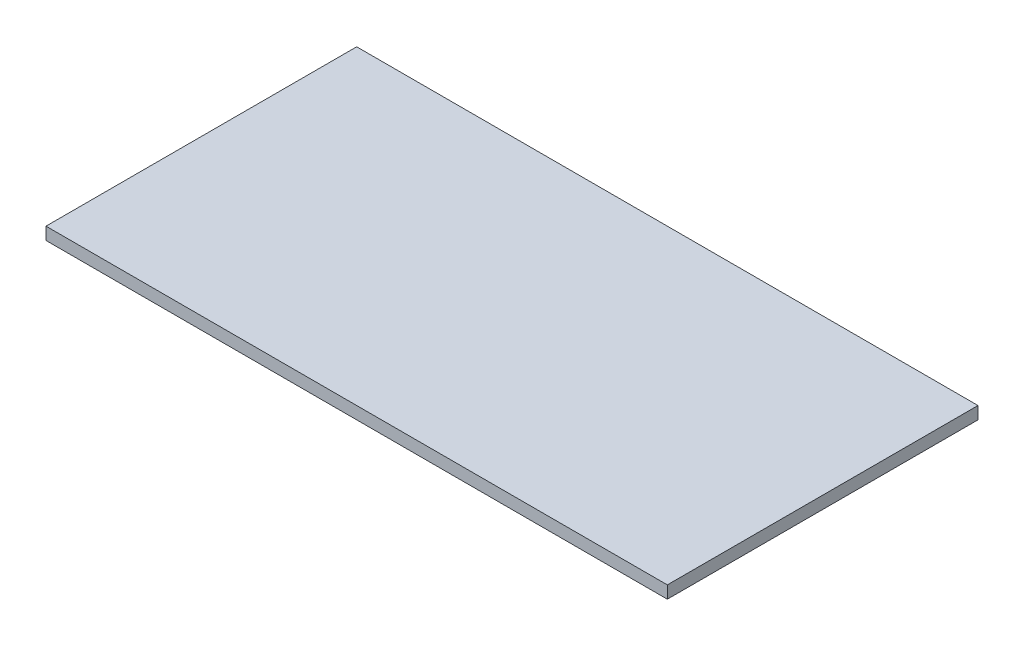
ISO-10303-21;
HEADER;
FILE_DESCRIPTION(('STEP AP214'),'2;1');
FILE_NAME('part.step','',(''),(''),'','','');
FILE_SCHEMA(('AUTOMOTIVE_DESIGN { 1 0 10303 214 1 1 1 1 }'));
ENDSEC;
DATA;
#1=APPLICATION_CONTEXT('core data for automotive mechanical design processes');
#2=APPLICATION_PROTOCOL_DEFINITION('international standard','automotive_design',2000,#1);
#3=PRODUCT_CONTEXT('',#1,'mechanical');
#4=PRODUCT('Part','Part','',(#3));
#5=PRODUCT_RELATED_PRODUCT_CATEGORY('part','',(#4));
#6=PRODUCT_DEFINITION_FORMATION('','',#4);
#7=PRODUCT_DEFINITION_CONTEXT('part definition',#1,'design');
#8=PRODUCT_DEFINITION('design','',#6,#7);
#9=PRODUCT_DEFINITION_SHAPE('','',#8);
#10=(LENGTH_UNIT() NAMED_UNIT(*) SI_UNIT(.MILLI.,.METRE.));
#11=(NAMED_UNIT(*) PLANE_ANGLE_UNIT() SI_UNIT($,.RADIAN.));
#12=(NAMED_UNIT(*) SI_UNIT($,.STERADIAN.) SOLID_ANGLE_UNIT());
#13=UNCERTAINTY_MEASURE_WITH_UNIT(LENGTH_MEASURE(1.E-05),#10,'distance_accuracy_value','');
#14=(GEOMETRIC_REPRESENTATION_CONTEXT(3) GLOBAL_UNCERTAINTY_ASSIGNED_CONTEXT((#13)) GLOBAL_UNIT_ASSIGNED_CONTEXT((#10,
#11,#12)) REPRESENTATION_CONTEXT('',''));
#15=CARTESIAN_POINT('',(0.,0.,0.));
#16=DIRECTION('',(0.,0.,1.));
#17=DIRECTION('',(1.,0.,0.));
#18=AXIS2_PLACEMENT_3D('',#15,#16,#17);
#19=CARTESIAN_POINT('',(-300.,-10.,-125.));
#20=DIRECTION('',(-1.,0.,0.));
#21=DIRECTION('',(0.,0.,1.));
#22=AXIS2_PLACEMENT_3D('',#19,#20,#21);
#23=PLANE('',#22);
#24=DIRECTION('',(0.,0.,1.));
#25=VECTOR('',#24,1.);
#26=CARTESIAN_POINT('',(-300.,0.,-125.));
#27=LINE('',#26,#25);
#28=CARTESIAN_POINT('',(-300.,0.,-125.));
#29=VERTEX_POINT('',#28);
#30=CARTESIAN_POINT('',(-300.,0.,125.));
#31=VERTEX_POINT('',#30);
#32=EDGE_CURVE('E99',#29,#31,#27,.T.);
#33=ORIENTED_EDGE('',*,*,#32,.F.);
#34=DIRECTION('',(0.,1.,0.));
#35=VECTOR('',#34,1.);
#36=CARTESIAN_POINT('',(-300.,-10.,-125.));
#37=LINE('',#36,#35);
#38=CARTESIAN_POINT('',(-300.,-10.,-125.));
#39=VERTEX_POINT('',#38);
#40=EDGE_CURVE('E11',#39,#29,#37,.T.);
#41=ORIENTED_EDGE('',*,*,#40,.F.);
#42=DIRECTION('',(0.,0.,1.));
#43=VECTOR('',#42,1.);
#44=CARTESIAN_POINT('',(-300.,-10.,-125.));
#45=LINE('',#44,#43);
#46=CARTESIAN_POINT('',(-300.,-10.,125.));
#47=VERTEX_POINT('',#46);
#48=EDGE_CURVE('E93',#39,#47,#45,.T.);
#49=ORIENTED_EDGE('',*,*,#48,.T.);
#50=DIRECTION('',(0.,1.,0.));
#51=VECTOR('',#50,1.);
#52=CARTESIAN_POINT('',(-300.,-10.,125.));
#53=LINE('',#52,#51);
#54=EDGE_CURVE('E38',#47,#31,#53,.T.);
#55=ORIENTED_EDGE('',*,*,#54,.T.);
#56=EDGE_LOOP('',(#33,#41,#49,#55));
#57=FACE_BOUND('',#56,.T.);
#58=ADVANCED_FACE('F35',(#57),#23,.T.);
#59=CARTESIAN_POINT('',(-300.,-10.,-125.));
#60=DIRECTION('',(0.,0.,-1.));
#61=DIRECTION('',(-1.,0.,0.));
#62=AXIS2_PLACEMENT_3D('',#59,#60,#61);
#63=PLANE('',#62);
#64=DIRECTION('',(-1.,0.,0.));
#65=VECTOR('',#64,1.);
#66=CARTESIAN_POINT('',(-300.,0.,-125.));
#67=LINE('',#66,#65);
#68=CARTESIAN_POINT('',(200.,0.,-125.));
#69=VERTEX_POINT('',#68);
#70=EDGE_CURVE('E95',#69,#29,#67,.T.);
#71=ORIENTED_EDGE('',*,*,#70,.F.);
#72=DIRECTION('',(0.,1.,0.));
#73=VECTOR('',#72,1.);
#74=CARTESIAN_POINT('',(200.,-10.,-125.));
#75=LINE('',#74,#73);
#76=CARTESIAN_POINT('',(200.,-10.,-125.));
#77=VERTEX_POINT('',#76);
#78=EDGE_CURVE('E44',#77,#69,#75,.T.);
#79=ORIENTED_EDGE('',*,*,#78,.F.);
#80=DIRECTION('',(-1.,0.,0.));
#81=VECTOR('',#80,1.);
#82=CARTESIAN_POINT('',(-300.,-10.,-125.));
#83=LINE('',#82,#81);
#84=EDGE_CURVE('E90',#77,#39,#83,.T.);
#85=ORIENTED_EDGE('',*,*,#84,.T.);
#86=ORIENTED_EDGE('',*,*,#40,.T.);
#87=EDGE_LOOP('',(#71,#79,#85,#86));
#88=FACE_BOUND('',#87,.T.);
#89=ADVANCED_FACE('F109',(#88),#63,.T.);
#90=CARTESIAN_POINT('',(200.,-10.,-125.));
#91=DIRECTION('',(1.,0.,0.));
#92=DIRECTION('',(0.,0.,-1.));
#93=AXIS2_PLACEMENT_3D('',#90,#91,#92);
#94=PLANE('',#93);
#95=DIRECTION('',(0.,0.,-1.));
#96=VECTOR('',#95,1.);
#97=CARTESIAN_POINT('',(200.,0.,-125.));
#98=LINE('',#97,#96);
#99=CARTESIAN_POINT('',(200.,0.,125.));
#100=VERTEX_POINT('',#99);
#101=EDGE_CURVE('E85',#100,#69,#98,.T.);
#102=ORIENTED_EDGE('',*,*,#101,.F.);
#103=DIRECTION('',(0.,1.,0.));
#104=VECTOR('',#103,1.);
#105=CARTESIAN_POINT('',(200.,-10.,125.));
#106=LINE('',#105,#104);
#107=CARTESIAN_POINT('',(200.,-10.,125.));
#108=VERTEX_POINT('',#107);
#109=EDGE_CURVE('E80',#108,#100,#106,.T.);
#110=ORIENTED_EDGE('',*,*,#109,.F.);
#111=DIRECTION('',(0.,0.,-1.));
#112=VECTOR('',#111,1.);
#113=CARTESIAN_POINT('',(200.,-10.,-125.));
#114=LINE('',#113,#112);
#115=EDGE_CURVE('E83',#108,#77,#114,.T.);
#116=ORIENTED_EDGE('',*,*,#115,.T.);
#117=ORIENTED_EDGE('',*,*,#78,.T.);
#118=EDGE_LOOP('',(#102,#110,#116,#117));
#119=FACE_BOUND('',#118,.T.);
#120=ADVANCED_FACE('F82',(#119),#94,.T.);
#121=CARTESIAN_POINT('',(-300.,-10.,125.));
#122=DIRECTION('',(0.,0.,1.));
#123=DIRECTION('',(1.,0.,0.));
#124=AXIS2_PLACEMENT_3D('',#121,#122,#123);
#125=PLANE('',#124);
#126=DIRECTION('',(1.,0.,0.));
#127=VECTOR('',#126,1.);
#128=CARTESIAN_POINT('',(-300.,0.,125.));
#129=LINE('',#128,#127);
#130=EDGE_CURVE('E102',#31,#100,#129,.T.);
#131=ORIENTED_EDGE('',*,*,#130,.F.);
#132=ORIENTED_EDGE('',*,*,#54,.F.);
#133=DIRECTION('',(1.,0.,0.));
#134=VECTOR('',#133,1.);
#135=CARTESIAN_POINT('',(-300.,-10.,125.));
#136=LINE('',#135,#134);
#137=EDGE_CURVE('E89',#47,#108,#136,.T.);
#138=ORIENTED_EDGE('',*,*,#137,.T.);
#139=ORIENTED_EDGE('',*,*,#109,.T.);
#140=EDGE_LOOP('',(#131,#132,#138,#139));
#141=FACE_BOUND('',#140,.T.);
#142=ADVANCED_FACE('F92',(#141),#125,.T.);
#143=CARTESIAN_POINT('',(-300.,-10.,125.));
#144=DIRECTION('',(0.,1.,0.));
#145=DIRECTION('',(0.,0.,1.));
#146=AXIS2_PLACEMENT_3D('',#143,#144,#145);
#147=PLANE('',#146);
#148=ORIENTED_EDGE('',*,*,#48,.F.);
#149=ORIENTED_EDGE('',*,*,#84,.F.);
#150=ORIENTED_EDGE('',*,*,#115,.F.);
#151=ORIENTED_EDGE('',*,*,#137,.F.);
#152=EDGE_LOOP('',(#148,#149,#150,#151));
#153=FACE_BOUND('',#152,.T.);
#154=ADVANCED_FACE('F88',(#153),#147,.F.);
#155=CARTESIAN_POINT('',(-300.,0.,125.));
#156=DIRECTION('',(0.,1.,0.));
#157=DIRECTION('',(0.,0.,1.));
#158=AXIS2_PLACEMENT_3D('',#155,#156,#157);
#159=PLANE('',#158);
#160=ORIENTED_EDGE('',*,*,#32,.T.);
#161=ORIENTED_EDGE('',*,*,#130,.T.);
#162=ORIENTED_EDGE('',*,*,#101,.T.);
#163=ORIENTED_EDGE('',*,*,#70,.T.);
#164=EDGE_LOOP('',(#160,#161,#162,#163));
#165=FACE_BOUND('',#164,.T.);
#166=ADVANCED_FACE('F108',(#165),#159,.T.);
#167=CLOSED_SHELL('',(#58,#89,#120,#142,#154,#166));
#168=MANIFOLD_SOLID_BREP('B2',#167);
#169=ADVANCED_BREP_SHAPE_REPRESENTATION('',(#18,#168),#14);
#170=SHAPE_DEFINITION_REPRESENTATION(#9,#169);
ENDSEC;
END-ISO-10303-21;
